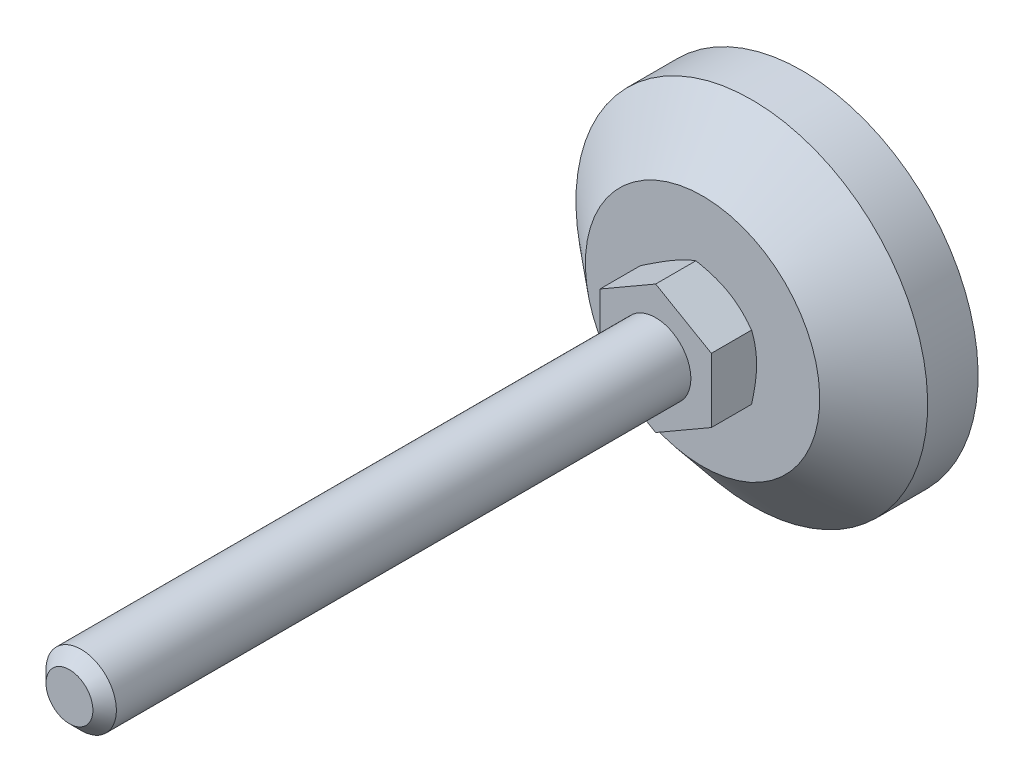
ISO-10303-21;
HEADER;
FILE_DESCRIPTION(('STEP AP214'),'2;1');
FILE_NAME('part.step','',(''),(''),'','','');
FILE_SCHEMA(('AUTOMOTIVE_DESIGN { 1 0 10303 214 1 1 1 1 }'));
ENDSEC;
DATA;
#1=APPLICATION_CONTEXT('core data for automotive mechanical design processes');
#2=APPLICATION_PROTOCOL_DEFINITION('international standard','automotive_design',2000,#1);
#3=PRODUCT_CONTEXT('',#1,'mechanical');
#4=PRODUCT('Part','Part','',(#3));
#5=PRODUCT_RELATED_PRODUCT_CATEGORY('part','',(#4));
#6=PRODUCT_DEFINITION_FORMATION('','',#4);
#7=PRODUCT_DEFINITION_CONTEXT('part definition',#1,'design');
#8=PRODUCT_DEFINITION('design','',#6,#7);
#9=PRODUCT_DEFINITION_SHAPE('','',#8);
#10=(LENGTH_UNIT() NAMED_UNIT(*) SI_UNIT(.MILLI.,.METRE.));
#11=(NAMED_UNIT(*) PLANE_ANGLE_UNIT() SI_UNIT($,.RADIAN.));
#12=(NAMED_UNIT(*) SI_UNIT($,.STERADIAN.) SOLID_ANGLE_UNIT());
#13=UNCERTAINTY_MEASURE_WITH_UNIT(LENGTH_MEASURE(1.E-05),#10,'distance_accuracy_value','');
#14=(GEOMETRIC_REPRESENTATION_CONTEXT(3) GLOBAL_UNCERTAINTY_ASSIGNED_CONTEXT((#13)) GLOBAL_UNIT_ASSIGNED_CONTEXT((#10,
#11,#12)) REPRESENTATION_CONTEXT('',''));
#15=CARTESIAN_POINT('',(0.,0.,0.));
#16=DIRECTION('',(0.,0.,1.));
#17=DIRECTION('',(1.,0.,0.));
#18=AXIS2_PLACEMENT_3D('',#15,#16,#17);
#19=CARTESIAN_POINT('',(0.,0.,25.));
#20=DIRECTION('',(0.,0.,1.));
#21=DIRECTION('',(0.5,-0.866025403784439,0.));
#22=AXIS2_PLACEMENT_3D('',#19,#20,#21);
#23=PLANE('',#22);
#24=DIRECTION('',(0.,1.,0.));
#25=VECTOR('',#24,1.);
#26=CARTESIAN_POINT('',(9.5,-5.48482755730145,25.));
#27=LINE('',#26,#25);
#28=CARTESIAN_POINT('',(9.5,-5.48482755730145,25.));
#29=VERTEX_POINT('',#28);
#30=CARTESIAN_POINT('',(9.5,5.48482755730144,25.));
#31=VERTEX_POINT('',#30);
#32=EDGE_CURVE('E197',#29,#31,#27,.T.);
#33=ORIENTED_EDGE('',*,*,#32,.T.);
#34=DIRECTION('',(-0.866025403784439,0.5,0.));
#35=VECTOR('',#34,1.);
#36=CARTESIAN_POINT('',(9.5,5.48482755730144,25.));
#37=LINE('',#36,#35);
#38=CARTESIAN_POINT('',(0.,10.9696551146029,25.));
#39=VERTEX_POINT('',#38);
#40=EDGE_CURVE('E320',#31,#39,#37,.T.);
#41=ORIENTED_EDGE('',*,*,#40,.T.);
#42=DIRECTION('',(-0.866025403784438,-0.5,0.));
#43=VECTOR('',#42,1.);
#44=CARTESIAN_POINT('',(0.,10.9696551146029,25.));
#45=LINE('',#44,#43);
#46=CARTESIAN_POINT('',(-9.5,5.48482755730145,25.));
#47=VERTEX_POINT('',#46);
#48=EDGE_CURVE('E319',#39,#47,#45,.T.);
#49=ORIENTED_EDGE('',*,*,#48,.T.);
#50=DIRECTION('',(0.,-1.,0.));
#51=VECTOR('',#50,1.);
#52=CARTESIAN_POINT('',(-9.5,5.48482755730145,25.));
#53=LINE('',#52,#51);
#54=CARTESIAN_POINT('',(-9.5,-5.48482755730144,25.));
#55=VERTEX_POINT('',#54);
#56=EDGE_CURVE('E324',#47,#55,#53,.T.);
#57=ORIENTED_EDGE('',*,*,#56,.T.);
#58=DIRECTION('',(0.866025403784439,-0.5,0.));
#59=VECTOR('',#58,1.);
#60=CARTESIAN_POINT('',(-9.5,-5.48482755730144,25.));
#61=LINE('',#60,#59);
#62=CARTESIAN_POINT('',(0.,-10.9696551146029,25.));
#63=VERTEX_POINT('',#62);
#64=EDGE_CURVE('E326',#55,#63,#61,.T.);
#65=ORIENTED_EDGE('',*,*,#64,.T.);
#66=DIRECTION('',(0.866025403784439,0.5,0.));
#67=VECTOR('',#66,1.);
#68=CARTESIAN_POINT('',(0.,-10.9696551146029,25.));
#69=LINE('',#68,#67);
#70=EDGE_CURVE('E37',#63,#29,#69,.T.);
#71=ORIENTED_EDGE('',*,*,#70,.T.);
#72=EDGE_LOOP('',(#33,#41,#49,#57,#65,#71));
#73=FACE_BOUND('',#72,.T.);
#74=CARTESIAN_POINT('',(0.,0.,25.));
#75=DIRECTION('',(0.,0.,1.));
#76=DIRECTION('',(0.5,-0.866025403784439,0.));
#77=AXIS2_PLACEMENT_3D('',#74,#75,#76);
#78=CIRCLE('',#77,6.);
#79=CARTESIAN_POINT('',(3.,-5.19615242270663,25.));
#80=VERTEX_POINT('',#79);
#81=EDGE_CURVE('E201',#80,#80,#78,.T.);
#82=ORIENTED_EDGE('',*,*,#81,.F.);
#83=EDGE_LOOP('',(#82));
#84=FACE_BOUND('',#83,.T.);
#85=ADVANCED_FACE('F14',(#73,#84),#23,.T.);
#86=CARTESIAN_POINT('',(-9.99463491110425,17.3112154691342,17.));
#87=DIRECTION('',(0.,0.,1.));
#88=DIRECTION('',(0.5,-0.866025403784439,0.));
#89=AXIS2_PLACEMENT_3D('',#86,#87,#88);
#90=PLANE('',#89);
#91=CARTESIAN_POINT('',(0.,0.,17.));
#92=DIRECTION('',(0.,0.,-1.));
#93=DIRECTION('',(-0.5,0.866025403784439,0.));
#94=AXIS2_PLACEMENT_3D('',#91,#92,#93);
#95=CIRCLE('',#94,19.9892698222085);
#96=CARTESIAN_POINT('',(-9.99463491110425,17.3112154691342,17.));
#97=VERTEX_POINT('',#96);
#98=EDGE_CURVE('E102',#97,#97,#95,.T.);
#99=ORIENTED_EDGE('',*,*,#98,.F.);
#100=EDGE_LOOP('',(#99));
#101=FACE_BOUND('',#100,.T.);
#102=CARTESIAN_POINT('',(0.,0.,17.));
#103=DIRECTION('',(0.,0.,-1.));
#104=DIRECTION('',(-0.5,0.866025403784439,0.));
#105=AXIS2_PLACEMENT_3D('',#102,#103,#104);
#106=CIRCLE('',#105,9.);
#107=CARTESIAN_POINT('',(-4.5,7.79422863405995,17.));
#108=VERTEX_POINT('',#107);
#109=EDGE_CURVE('E84',#108,#108,#106,.T.);
#110=ORIENTED_EDGE('',*,*,#109,.T.);
#111=EDGE_LOOP('',(#110));
#112=FACE_BOUND('',#111,.T.);
#113=ADVANCED_FACE('F174',(#101,#112),#90,.T.);
#114=CARTESIAN_POINT('',(0.,0.,0.));
#115=DIRECTION('',(0.,0.,-1.));
#116=DIRECTION('',(-0.5,0.866025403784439,0.));
#117=AXIS2_PLACEMENT_3D('',#114,#115,#116);
#118=PLANE('',#117);
#119=CARTESIAN_POINT('',(0.,0.,0.));
#120=DIRECTION('',(0.,0.,-1.));
#121=DIRECTION('',(-0.5,0.866025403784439,0.));
#122=AXIS2_PLACEMENT_3D('',#119,#120,#121);
#123=CIRCLE('',#122,30.);
#124=CARTESIAN_POINT('',(-15.,25.9807621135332,0.));
#125=VERTEX_POINT('',#124);
#126=EDGE_CURVE('E73',#125,#125,#123,.T.);
#127=ORIENTED_EDGE('',*,*,#126,.T.);
#128=EDGE_LOOP('',(#127));
#129=FACE_BOUND('',#128,.T.);
#130=ADVANCED_FACE('F177',(#129),#118,.T.);
#131=CARTESIAN_POINT('',(0.,0.,-75.4972525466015));
#132=DIRECTION('',(0.,0.,-1.));
#133=DIRECTION('',(-0.5,0.866025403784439,0.));
#134=AXIS2_PLACEMENT_3D('',#131,#132,#133);
#135=CYLINDRICAL_SURFACE('',#134,30.);
#136=CARTESIAN_POINT('',(0.,0.,8.6));
#137=DIRECTION('',(0.,0.,-1.));
#138=DIRECTION('',(-0.5,0.866025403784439,0.));
#139=AXIS2_PLACEMENT_3D('',#136,#137,#138);
#140=CIRCLE('',#139,30.);
#141=CARTESIAN_POINT('',(-15.,25.9807621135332,8.6));
#142=VERTEX_POINT('',#141);
#143=EDGE_CURVE('E105',#142,#142,#140,.T.);
#144=ORIENTED_EDGE('',*,*,#143,.T.);
#145=EDGE_LOOP('',(#144));
#146=FACE_BOUND('',#145,.T.);
#147=ORIENTED_EDGE('',*,*,#126,.F.);
#148=EDGE_LOOP('',(#147));
#149=FACE_BOUND('',#148,.T.);
#150=ADVANCED_FACE('F181',(#146,#149),#135,.T.);
#151=CARTESIAN_POINT('',(0.,0.,8.6));
#152=DIRECTION('',(0.,0.,-1.));
#153=DIRECTION('',(-0.5,0.866025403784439,0.));
#154=AXIS2_PLACEMENT_3D('',#151,#152,#153);
#155=CONICAL_SURFACE('',#154,30.,0.872664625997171);
#156=ORIENTED_EDGE('',*,*,#98,.T.);
#157=EDGE_LOOP('',(#156));
#158=FACE_BOUND('',#157,.T.);
#159=ORIENTED_EDGE('',*,*,#143,.F.);
#160=EDGE_LOOP('',(#159));
#161=FACE_BOUND('',#160,.T.);
#162=ADVANCED_FACE('F121',(#158,#161),#155,.T.);
#163=CARTESIAN_POINT('',(0.,0.,20.2070856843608));
#164=DIRECTION('',(0.,0.,1.));
#165=DIRECTION('',(0.5,-0.866025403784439,0.));
#166=AXIS2_PLACEMENT_3D('',#163,#164,#165);
#167=CONICAL_SURFACE('',#166,14.5548353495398,1.0471975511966);
#168=ORIENTED_EDGE('',*,*,#109,.F.);
#169=EDGE_LOOP('',(#168));
#170=FACE_BOUND('',#169,.T.);
#171=CARTESIAN_POINT('',(-8.0629212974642,-15.6247848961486,21.955113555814));
#172=CARTESIAN_POINT('',(-7.88302842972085,-15.5209237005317,21.8541996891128));
#173=CARTESIAN_POINT('',(-7.70292590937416,-15.4169414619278,21.7537843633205));
#174=CARTESIAN_POINT('',(-7.34225784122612,-15.2087096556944,21.5540635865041));
#175=CARTESIAN_POINT('',(-7.16169228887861,-15.1044600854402,21.4547581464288));
#176=CARTESIAN_POINT('',(-6.61918813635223,-14.7912451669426,21.158650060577));
#177=CARTESIAN_POINT('',(-6.25649443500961,-14.5818438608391,20.9636851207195));
#178=CARTESIAN_POINT('',(-5.52674967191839,-14.1605255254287,20.5787866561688));
#179=CARTESIAN_POINT('',(-5.15968567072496,-13.9486010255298,20.3888857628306));
#180=CARTESIAN_POINT('',(-4.42265753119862,-13.5230776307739,20.016769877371));
#181=CARTESIAN_POINT('',(-4.05269352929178,-13.3094788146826,19.834554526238));
#182=CARTESIAN_POINT('',(-3.29714002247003,-12.8732597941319,19.4740509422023));
#183=CARTESIAN_POINT('',(-2.911434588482,-12.650572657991,19.2960849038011));
#184=CARTESIAN_POINT('',(-2.1355321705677,-12.2026051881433,18.953471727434));
#185=CARTESIAN_POINT('',(-1.74533469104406,-11.9773245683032,18.7888260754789));
#186=CARTESIAN_POINT('',(-0.960535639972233,-11.5242206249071,18.4771310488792));
#187=CARTESIAN_POINT('',(-0.565944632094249,-11.2964034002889,18.3300465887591));
#188=CARTESIAN_POINT('',(0.228883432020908,-10.8375092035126,18.0581506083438));
#189=CARTESIAN_POINT('',(0.62911868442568,-10.6064332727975,17.9333321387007));
#190=CARTESIAN_POINT('',(1.43330236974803,-10.1421376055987,17.7125905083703));
#191=CARTESIAN_POINT('',(1.83721725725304,-9.90893723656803,17.6165087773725));
#192=CARTESIAN_POINT('',(2.44681047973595,-9.55698842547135,17.4980679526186));
#193=CARTESIAN_POINT('',(2.65064289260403,-9.4393057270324,17.4628663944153));
#194=CARTESIAN_POINT('',(3.05933909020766,-9.20334486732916,17.4017128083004));
#195=CARTESIAN_POINT('',(3.26420277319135,-9.08506676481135,17.3757598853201));
#196=CARTESIAN_POINT('',(3.67198665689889,-8.84963262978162,17.3339494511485));
#197=CARTESIAN_POINT('',(3.87489694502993,-8.73248232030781,17.3179635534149));
#198=CARTESIAN_POINT('',(4.28112129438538,-8.49794858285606,17.2959174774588));
#199=CARTESIAN_POINT('',(4.48443534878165,-8.38056515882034,17.2898571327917));
#200=CARTESIAN_POINT('',(4.89110353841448,-8.14577517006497,17.2878069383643));
#201=CARTESIAN_POINT('',(5.09445767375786,-8.02836860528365,17.2918171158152));
#202=CARTESIAN_POINT('',(5.50083733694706,-7.79374519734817,17.3098091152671));
#203=CARTESIAN_POINT('',(5.70386284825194,-7.67652836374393,17.3237914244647));
#204=CARTESIAN_POINT('',(6.19015483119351,-7.39576755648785,17.3689276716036));
#205=CARTESIAN_POINT('',(6.47310620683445,-7.23240550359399,17.4047077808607));
#206=CARTESIAN_POINT('',(7.03693098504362,-6.90688111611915,17.4936993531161));
#207=CARTESIAN_POINT('',(7.31780410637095,-6.74471894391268,17.546913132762));
#208=CARTESIAN_POINT('',(8.15697152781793,-6.2602254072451,17.729885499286));
#209=CARTESIAN_POINT('',(8.71150741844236,-5.94006396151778,17.8829428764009));
#210=CARTESIAN_POINT('',(9.54078576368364,-5.4612798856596,18.148698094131));
#211=CARTESIAN_POINT('',(9.819821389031,-5.30017859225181,18.2445639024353));
#212=CARTESIAN_POINT('',(10.375183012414,-4.97954040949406,18.4463370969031));
#213=CARTESIAN_POINT('',(10.6515089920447,-4.82000353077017,18.552244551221));
#214=CARTESIAN_POINT('',(11.201537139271,-4.50244463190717,18.7723946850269));
#215=CARTESIAN_POINT('',(11.4752401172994,-4.34442214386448,18.8866346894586));
#216=CARTESIAN_POINT('',(12.0203730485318,-4.02968949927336,19.1220972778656));
#217=CARTESIAN_POINT('',(12.2918030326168,-3.87297932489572,19.2433197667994));
#218=CARTESIAN_POINT('',(12.9489666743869,-3.4935657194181,19.544986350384));
#219=CARTESIAN_POINT('',(13.3336498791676,-3.27146876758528,19.7284765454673));
#220=CARTESIAN_POINT('',(14.0996081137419,-2.82924257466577,20.104736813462));
#221=CARTESIAN_POINT('',(14.4808829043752,-2.60911347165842,20.2975075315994));
#222=CARTESIAN_POINT('',(15.2406869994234,-2.170440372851,20.6904048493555));
#223=CARTESIAN_POINT('',(15.619215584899,-1.95189679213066,20.8905332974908));
#224=CARTESIAN_POINT('',(16.3739075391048,-1.51617518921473,21.2966079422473));
#225=CARTESIAN_POINT('',(16.7500709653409,-1.29899713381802,21.5025539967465));
#226=CARTESIAN_POINT('',(17.5008876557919,-0.865512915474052,21.9193891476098));
#227=CARTESIAN_POINT('',(17.8755385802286,-0.649208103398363,22.1302838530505));
#228=CARTESIAN_POINT('',(18.6232021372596,-0.217544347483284,22.5559100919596));
#229=CARTESIAN_POINT('',(18.9962147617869,-0.00218540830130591,22.7706416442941));
#230=CARTESIAN_POINT('',(19.7408074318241,0.42770537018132,23.203233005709));
#231=CARTESIAN_POINT('',(20.112387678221,0.642237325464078,23.4210923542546));
#232=CARTESIAN_POINT('',(20.8543824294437,1.07062819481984,23.8594435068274));
#233=CARTESIAN_POINT('',(21.2247969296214,1.28448710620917,24.0799353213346));
#234=CARTESIAN_POINT('',(22.2694002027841,1.88758908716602,24.7056802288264));
#235=CARTESIAN_POINT('',(22.9424390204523,2.2761682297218,25.1134927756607));
#236=CARTESIAN_POINT('',(24.2860532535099,3.05190426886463,25.9345548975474));
#237=CARTESIAN_POINT('',(24.9566285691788,3.439061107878,26.3478046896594));
#238=CARTESIAN_POINT('',(26.2940646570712,4.21123019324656,27.1773352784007));
#239=CARTESIAN_POINT('',(26.9609305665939,4.59624540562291,27.5936050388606));
#240=CARTESIAN_POINT('',(27.9600759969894,5.17310228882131,28.2204041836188));
#241=CARTESIAN_POINT('',(28.2929225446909,5.3652713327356,28.4297301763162));
#242=CARTESIAN_POINT('',(28.958275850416,5.74941324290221,28.8490996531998));
#243=CARTESIAN_POINT('',(29.2907826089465,5.94138610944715,29.0591431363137));
#244=CARTESIAN_POINT('',(29.6231390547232,6.13327219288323,29.269503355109));
#245=B_SPLINE_CURVE_WITH_KNOTS('',3,(#171,#172,#173,#174,#175,#176,#177,#178,#179,#180,#181,
#182,#183,#184,#185,#186,#187,#188,#189,#190,#191,#192,#193,#194,#195,#196,#197,#198,#199,#200,
#201,#202,#203,#204,#205,#206,#207,#208,#209,#210,#211,#212,#213,#214,#215,#216,#217,#218,#219,
#220,#221,#222,#223,#224,#225,#226,#227,#228,#229,#230,#231,#232,#233,#234,#235,#236,#237,#238,
#239,#240,#241,#242,#243,#244),.UNSPECIFIED.,.F.,.F.,(4,2,2,2,2,2,2,2,2,2,2,2,2,2,2,2,2,2,2,2,2,
2,2,2,2,2,2,2,2,2,2,2,2,2,2,2,4),(0.,0.692811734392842,1.38563029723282,2.7714693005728,
4.16474840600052,5.55796235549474,6.99664082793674,8.43547957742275,9.87139378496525,
11.3068590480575,12.734250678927,13.4480473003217,14.1617748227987,14.8661077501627,
15.5704288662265,16.2747518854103,16.9791093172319,17.9645860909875,18.9501938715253,
20.9224706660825,21.9308705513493,22.9392772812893,23.9473616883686,24.9554323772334,
26.397088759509,27.838845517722,29.2809670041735,30.7230532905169,32.1668616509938,
33.6106771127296,35.0542821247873,36.4978928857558,39.1308383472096,41.7638892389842,
44.3899112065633,45.7028456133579,47.0157780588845),.UNSPECIFIED.);
#246=CARTESIAN_POINT('',(0.,-10.9696551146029,18.1371809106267));
#247=VERTEX_POINT('',#246);
#248=CARTESIAN_POINT('',(9.5,-5.48482755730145,18.1371809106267));
#249=VERTEX_POINT('',#248);
#250=EDGE_CURVE('E65',#247,#249,#245,.T.);
#251=ORIENTED_EDGE('',*,*,#250,.F.);
#252=CARTESIAN_POINT('',(-9.5002,-5.4847120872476,18.137247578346));
#253=CARTESIAN_POINT('',(-9.29136922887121,-5.60528058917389,18.0676485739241));
#254=CARTESIAN_POINT('',(-9.0817598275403,-5.72629863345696,18.0012084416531));
#255=CARTESIAN_POINT('',(-8.66086011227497,-5.96930519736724,17.8755224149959));
#256=CARTESIAN_POINT('',(-8.44956926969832,-6.09129402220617,17.8162788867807));
#257=CARTESIAN_POINT('',(-7.81229220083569,-6.45922610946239,17.6504897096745));
#258=CARTESIAN_POINT('',(-7.38379023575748,-6.70662183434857,17.5561895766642));
#259=CARTESIAN_POINT('',(-6.74255666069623,-7.07683821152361,17.4456138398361));
#260=CARTESIAN_POINT('',(-6.53174078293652,-7.19855281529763,17.4141149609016));
#261=CARTESIAN_POINT('',(-6.10913296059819,-7.4425455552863,17.3612933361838));
#262=CARTESIAN_POINT('',(-5.89734099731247,-7.56482370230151,17.3399707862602));
#263=CARTESIAN_POINT('',(-5.47340378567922,-7.80958396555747,17.3080481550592));
#264=CARTESIAN_POINT('',(-5.26125925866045,-7.93206566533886,17.2974353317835));
#265=CARTESIAN_POINT('',(-4.83677424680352,-8.17714220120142,17.2871576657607));
#266=CARTESIAN_POINT('',(-4.62443376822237,-8.29973703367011,17.2874924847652));
#267=CARTESIAN_POINT('',(-4.22745800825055,-8.5289310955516,17.2983485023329));
#268=CARTESIAN_POINT('',(-4.04279470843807,-8.63554650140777,17.3075454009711));
#269=CARTESIAN_POINT('',(-3.67389999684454,-8.84852796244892,17.3340405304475));
#270=CARTESIAN_POINT('',(-3.48966861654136,-8.95489399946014,17.3513393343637));
#271=CARTESIAN_POINT('',(-2.937688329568,-9.27357996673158,17.414979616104));
#272=CARTESIAN_POINT('',(-2.57091646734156,-9.48533580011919,17.4730570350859));
#273=CARTESIAN_POINT('',(-1.83348217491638,-9.91109368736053,17.618251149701));
#274=CARTESIAN_POINT('',(-1.46291385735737,-10.1250414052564,17.7059833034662));
#275=CARTESIAN_POINT('',(-0.727303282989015,-10.5497463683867,17.9050988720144));
#276=CARTESIAN_POINT('',(-0.362251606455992,-10.7605090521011,18.0164355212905));
#277=CARTESIAN_POINT('',(0.000200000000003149,-10.9697705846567,18.137247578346));
#278=B_SPLINE_CURVE_WITH_KNOTS('',3,(#252,#253,#254,#255,#256,#257,#258,#259,#260,#261,#262,
#263,#264,#265,#266,#267,#268,#269,#270,#271,#272,#273,#274,#275,#276,#277),.UNSPECIFIED.,.F.,
.F.,(4,2,2,2,2,2,2,2,2,2,2,2,4),(0.,0.752880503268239,1.50600787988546,3.0154687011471,
3.75167336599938,4.48789219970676,5.22323407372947,5.95855322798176,6.59868084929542,
7.23885375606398,8.52010929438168,9.82978009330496,11.1368800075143),.UNSPECIFIED.);
#279=CARTESIAN_POINT('',(-9.5,-5.48482755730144,18.1371809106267));
#280=VERTEX_POINT('',#279);
#281=EDGE_CURVE('E68',#280,#247,#278,.T.);
#282=ORIENTED_EDGE('',*,*,#281,.F.);
#283=CARTESIAN_POINT('',(-9.5,5.48505849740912,18.137247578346));
#284=CARTESIAN_POINT('',(-9.5,5.24392149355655,18.0676485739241));
#285=CARTESIAN_POINT('',(-9.5,5.0018854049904,18.0012084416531));
#286=CARTESIAN_POINT('',(-9.5,4.51587227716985,17.8755224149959));
#287=CARTESIAN_POINT('',(-9.5,4.27189462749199,17.8162788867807));
#288=CARTESIAN_POINT('',(-9.5,3.53603045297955,17.6504897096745));
#289=CARTESIAN_POINT('',(-9.5,3.04123900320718,17.5561895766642));
#290=CARTESIAN_POINT('',(-9.5,2.3008062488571,17.4456138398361));
#291=CARTESIAN_POINT('',(-9.5,2.05737704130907,17.4141149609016));
#292=CARTESIAN_POINT('',(-9.5,1.56939156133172,17.3612933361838));
#293=CARTESIAN_POINT('',(-9.5,1.32483526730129,17.3399707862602));
#294=CARTESIAN_POINT('',(-9.5,0.835314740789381,17.3080481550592));
#295=CARTESIAN_POINT('',(-9.5,0.590351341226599,17.2974353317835));
#296=CARTESIAN_POINT('',(-9.5,0.100198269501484,17.2871576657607));
#297=CARTESIAN_POINT('',(-9.5,-0.144991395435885,17.2874924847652));
#298=CARTESIAN_POINT('',(-9.5,-0.603379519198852,17.2983485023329));
#299=CARTESIAN_POINT('',(-9.5,-0.816610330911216,17.3075454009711));
#300=CARTESIAN_POINT('',(-9.5,-1.24257325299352,17.3340405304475));
#301=CARTESIAN_POINT('',(-9.5,-1.45530532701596,17.3513393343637));
#302=CARTESIAN_POINT('',(-9.5,-2.09267726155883,17.414979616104));
#303=CARTESIAN_POINT('',(-9.5,-2.51618892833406,17.4730570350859));
#304=CARTESIAN_POINT('',(-9.5,-3.36770470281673,17.618251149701));
#305=CARTESIAN_POINT('',(-9.5,-3.79560013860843,17.7059833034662));
#306=CARTESIAN_POINT('',(-9.5,-4.64501006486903,17.9050988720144));
#307=CARTESIAN_POINT('',(-9.5,-5.06653543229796,18.0164355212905));
#308=CARTESIAN_POINT('',(-9.5,-5.48505849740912,18.137247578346));
#309=B_SPLINE_CURVE_WITH_KNOTS('',3,(#283,#284,#285,#286,#287,#288,#289,#290,#291,#292,#293,
#294,#295,#296,#297,#298,#299,#300,#301,#302,#303,#304,#305,#306,#307,#308),.UNSPECIFIED.,.F.,
.F.,(4,2,2,2,2,2,2,2,2,2,2,2,4),(0.,0.752880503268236,1.50600787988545,3.0154687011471,
3.75167336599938,4.48789219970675,5.22323407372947,5.95855322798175,6.59868084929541,
7.23885375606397,8.52010929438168,9.82978009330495,11.1368800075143),.UNSPECIFIED.);
#310=CARTESIAN_POINT('',(-9.5,5.48482755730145,18.1371809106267));
#311=VERTEX_POINT('',#310);
#312=EDGE_CURVE('E83',#311,#280,#309,.T.);
#313=ORIENTED_EDGE('',*,*,#312,.F.);
#314=CARTESIAN_POINT('',(-17.5629212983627,0.829697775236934,21.9551135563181));
#315=CARTESIAN_POINT('',(-17.3830284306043,0.933558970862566,21.8541996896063));
#316=CARTESIAN_POINT('',(-17.2029259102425,1.03754120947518,21.7537843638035));
#317=CARTESIAN_POINT('',(-16.8422578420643,1.245773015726,21.5540635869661));
#318=CARTESIAN_POINT('',(-16.6616922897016,1.35002258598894,21.4547581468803));
#319=CARTESIAN_POINT('',(-16.1191881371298,1.66323750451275,21.1586500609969));
#320=CARTESIAN_POINT('',(-15.7564944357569,1.8726388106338,20.9636851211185));
#321=CARTESIAN_POINT('',(-15.0267496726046,2.29395714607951,20.5787866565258));
#322=CARTESIAN_POINT('',(-14.6596856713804,2.50588164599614,20.3888857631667));
#323=CARTESIAN_POINT('',(-13.9226575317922,2.93140504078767,20.0167698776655));
#324=CARTESIAN_POINT('',(-13.5526935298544,3.14500385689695,19.8345545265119));
#325=CARTESIAN_POINT('',(-12.7971400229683,3.58122287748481,19.4740509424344));
#326=CARTESIAN_POINT('',(-12.4114345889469,3.80391001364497,19.296084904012));
#327=CARTESIAN_POINT('',(-11.6355321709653,4.25187748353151,18.9534717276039));
#328=CARTESIAN_POINT('',(-11.2453346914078,4.47715810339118,18.7888260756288));
#329=CARTESIAN_POINT('',(-10.4605356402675,4.93026204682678,18.477131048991));
#330=CARTESIAN_POINT('',(-10.065944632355,5.15807927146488,18.3300465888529));
#331=CARTESIAN_POINT('',(-9.27111656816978,5.61697346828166,18.0581506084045));
#332=CARTESIAN_POINT('',(-8.87088131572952,5.84804939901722,17.9333321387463));
#333=CARTESIAN_POINT('',(-8.06669763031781,6.31234506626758,17.7125905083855));
#334=CARTESIAN_POINT('',(-7.66278274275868,6.54554543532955,17.6165087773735));
#335=CARTESIAN_POINT('',(-7.05318952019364,6.89749424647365,17.4980679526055));
#336=CARTESIAN_POINT('',(-6.84935710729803,7.0151769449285,17.4628663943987));
#337=CARTESIAN_POINT('',(-6.44066090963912,7.25113780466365,17.4017128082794));
#338=CARTESIAN_POINT('',(-6.23579722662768,7.36941590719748,17.3757598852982));
#339=CARTESIAN_POINT('',(-5.82801334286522,7.60485004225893,17.3339494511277));
#340=CARTESIAN_POINT('',(-5.62510305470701,7.72200035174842,17.3179635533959));
#341=CARTESIAN_POINT('',(-5.21887870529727,7.95653408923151,17.2959174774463));
#342=CARTESIAN_POINT('',(-5.01556465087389,8.07391751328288,17.2898571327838));
#343=CARTESIAN_POINT('',(-4.60889646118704,8.30870750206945,17.2878069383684));
#344=CARTESIAN_POINT('',(-4.40554232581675,8.42611406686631,17.2918171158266));
#345=CARTESIAN_POINT('',(-3.9991626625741,8.66073747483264,17.3098091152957));
#346=CARTESIAN_POINT('',(-3.79613715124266,8.7779543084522,17.3237914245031));
#347=CARTESIAN_POINT('',(-3.30984516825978,9.05871511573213,17.3689276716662));
#348=CARTESIAN_POINT('',(-3.0268937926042,9.22207716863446,17.4047077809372));
#349=CARTESIAN_POINT('',(-2.46306901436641,9.54760155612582,17.4936993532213));
#350=CARTESIAN_POINT('',(-2.18219589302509,9.70976372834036,17.5469131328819));
#351=CARTESIAN_POINT('',(-1.34302847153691,10.1942572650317,17.7298854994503));
#352=CARTESIAN_POINT('',(-0.788492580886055,10.5144187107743,17.8829428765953));
#353=CARTESIAN_POINT('',(0.0407857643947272,10.9932027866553,18.1486980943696));
#354=CARTESIAN_POINT('',(0.319821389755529,11.1543040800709,18.2445639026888));
#355=CARTESIAN_POINT('',(0.875183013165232,11.474942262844,18.4463370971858));
#356=CARTESIAN_POINT('',(1.15150899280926,11.6344791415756,18.5522445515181));
#357=CARTESIAN_POINT('',(1.70153714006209,11.9520380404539,18.7723946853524));
#358=CARTESIAN_POINT('',(1.97524011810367,12.1100605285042,18.886634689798));
#359=CARTESIAN_POINT('',(2.52037304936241,12.4247931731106,19.1220972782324));
#360=CARTESIAN_POINT('',(2.79180303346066,12.5815033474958,19.2433197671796));
#361=CARTESIAN_POINT('',(3.44896667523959,12.9609169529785,19.5449863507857));
#362=CARTESIAN_POINT('',(3.8336498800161,13.183013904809,19.728476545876));
#363=CARTESIAN_POINT('',(4.5996081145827,13.625240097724,20.1047368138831));
#364=CARTESIAN_POINT('',(4.98088290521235,13.8453692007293,20.2975075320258));
#365=CARTESIAN_POINT('',(5.74068700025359,14.2840422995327,20.6904048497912));
#366=CARTESIAN_POINT('',(6.11921558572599,14.5025858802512,20.8905332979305));
#367=CARTESIAN_POINT('',(6.87390753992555,14.9383074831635,21.2966079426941));
#368=CARTESIAN_POINT('',(7.25007096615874,15.1554855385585,21.5025539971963));
#369=CARTESIAN_POINT('',(8.00088765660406,15.5889697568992,21.9193891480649));
#370=CARTESIAN_POINT('',(8.37553858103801,15.8052745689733,22.1302838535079));
#371=CARTESIAN_POINT('',(9.12320213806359,16.2369383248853,22.5559100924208));
#372=CARTESIAN_POINT('',(9.49621476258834,16.4522972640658,22.7706416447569));
#373=CARTESIAN_POINT('',(10.2408074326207,16.8821880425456,23.2032330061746));
#374=CARTESIAN_POINT('',(10.6123876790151,17.0967199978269,23.4210923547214));
#375=CARTESIAN_POINT('',(11.3543824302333,17.5251108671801,23.8594435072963));
#376=CARTESIAN_POINT('',(11.7247969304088,17.7389697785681,24.0799353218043));
#377=CARTESIAN_POINT('',(12.7694002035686,18.3420717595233,24.7056802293));
#378=CARTESIAN_POINT('',(13.4424390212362,18.7306509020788,25.113492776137));
#379=CARTESIAN_POINT('',(14.786053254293,19.5063869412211,25.9345548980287));
#380=CARTESIAN_POINT('',(15.4566285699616,19.8935437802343,26.3478046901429));
#381=CARTESIAN_POINT('',(16.7940646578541,20.665712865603,27.1773352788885));
#382=CARTESIAN_POINT('',(17.4609305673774,21.0507280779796,27.5936050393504));
#383=CARTESIAN_POINT('',(18.4600759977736,21.6275849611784,28.2204041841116));
#384=CARTESIAN_POINT('',(18.7929225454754,21.8197540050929,28.42973017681));
#385=CARTESIAN_POINT('',(19.4582758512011,22.2038959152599,28.8490996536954));
#386=CARTESIAN_POINT('',(19.7907826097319,22.395868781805,29.0591431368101));
#387=CARTESIAN_POINT('',(20.1231390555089,22.5877548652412,29.2695033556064));
#388=B_SPLINE_CURVE_WITH_KNOTS('',3,(#314,#315,#316,#317,#318,#319,#320,#321,#322,#323,#324,
#325,#326,#327,#328,#329,#330,#331,#332,#333,#334,#335,#336,#337,#338,#339,#340,#341,#342,#343,
#344,#345,#346,#347,#348,#349,#350,#351,#352,#353,#354,#355,#356,#357,#358,#359,#360,#361,#362,
#363,#364,#365,#366,#367,#368,#369,#370,#371,#372,#373,#374,#375,#376,#377,#378,#379,#380,#381,
#382,#383,#384,#385,#386,#387),.UNSPECIFIED.,.F.,.F.,(4,2,2,2,2,2,2,2,2,2,2,2,2,2,2,2,2,2,2,2,2,
2,2,2,2,2,2,2,2,2,2,2,2,2,2,2,4),(0.,0.692811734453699,1.38563029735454,2.77146930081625,
4.16474840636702,5.55796235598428,6.99664082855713,8.43547957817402,9.87139378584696,
11.3068590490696,12.7342506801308,13.4480473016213,14.1617748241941,14.8661077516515,
15.5704288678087,16.2747518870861,16.9791093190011,17.9645860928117,18.9501938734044,
20.9224706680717,21.9308705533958,22.9392772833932,23.9473616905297,24.9554323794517,
26.3970887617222,27.8388455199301,29.2809670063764,30.7230532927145,32.1668616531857,
33.6106771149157,35.0542821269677,36.4978928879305,39.1308383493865,41.7638892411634,
44.3899112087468,45.7028456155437,47.0157780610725),.UNSPECIFIED.);
#389=CARTESIAN_POINT('',(0.,10.9696551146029,18.1371809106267));
#390=VERTEX_POINT('',#389);
#391=EDGE_CURVE('E143',#390,#311,#388,.F.);
#392=ORIENTED_EDGE('',*,*,#391,.F.);
#393=CARTESIAN_POINT('',(9.5002,5.4847120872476,18.137247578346));
#394=CARTESIAN_POINT('',(9.29136922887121,5.60528058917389,18.0676485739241));
#395=CARTESIAN_POINT('',(9.0817598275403,5.72629863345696,18.0012084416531));
#396=CARTESIAN_POINT('',(8.66086011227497,5.96930519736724,17.8755224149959));
#397=CARTESIAN_POINT('',(8.44956926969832,6.09129402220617,17.8162788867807));
#398=CARTESIAN_POINT('',(7.81229220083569,6.45922610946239,17.6504897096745));
#399=CARTESIAN_POINT('',(7.38379023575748,6.70662183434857,17.5561895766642));
#400=CARTESIAN_POINT('',(6.74255666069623,7.07683821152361,17.4456138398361));
#401=CARTESIAN_POINT('',(6.53174078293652,7.19855281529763,17.4141149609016));
#402=CARTESIAN_POINT('',(6.10913296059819,7.4425455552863,17.3612933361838));
#403=CARTESIAN_POINT('',(5.89734099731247,7.56482370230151,17.3399707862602));
#404=CARTESIAN_POINT('',(5.47340378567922,7.80958396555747,17.3080481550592));
#405=CARTESIAN_POINT('',(5.26125925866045,7.93206566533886,17.2974353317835));
#406=CARTESIAN_POINT('',(4.83677424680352,8.17714220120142,17.2871576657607));
#407=CARTESIAN_POINT('',(4.62443376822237,8.29973703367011,17.2874924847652));
#408=CARTESIAN_POINT('',(4.22745800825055,8.5289310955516,17.2983485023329));
#409=CARTESIAN_POINT('',(4.04279470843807,8.63554650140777,17.3075454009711));
#410=CARTESIAN_POINT('',(3.67389999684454,8.84852796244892,17.3340405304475));
#411=CARTESIAN_POINT('',(3.48966861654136,8.95489399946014,17.3513393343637));
#412=CARTESIAN_POINT('',(2.937688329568,9.27357996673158,17.414979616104));
#413=CARTESIAN_POINT('',(2.57091646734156,9.48533580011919,17.4730570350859));
#414=CARTESIAN_POINT('',(1.83348217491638,9.91109368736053,17.618251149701));
#415=CARTESIAN_POINT('',(1.46291385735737,10.1250414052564,17.7059833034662));
#416=CARTESIAN_POINT('',(0.727303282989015,10.5497463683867,17.9050988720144));
#417=CARTESIAN_POINT('',(0.362251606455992,10.7605090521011,18.0164355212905));
#418=CARTESIAN_POINT('',(-0.000200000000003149,10.9697705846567,18.137247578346));
#419=B_SPLINE_CURVE_WITH_KNOTS('',3,(#393,#394,#395,#396,#397,#398,#399,#400,#401,#402,#403,
#404,#405,#406,#407,#408,#409,#410,#411,#412,#413,#414,#415,#416,#417,#418),.UNSPECIFIED.,.F.,
.F.,(4,2,2,2,2,2,2,2,2,2,2,2,4),(0.,0.752880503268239,1.50600787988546,3.0154687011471,
3.75167336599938,4.48789219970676,5.22323407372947,5.95855322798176,6.59868084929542,
7.23885375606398,8.52010929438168,9.82978009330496,11.1368800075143),.UNSPECIFIED.);
#420=CARTESIAN_POINT('',(9.5,5.48482755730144,18.1371809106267));
#421=VERTEX_POINT('',#420);
#422=EDGE_CURVE('E150',#421,#390,#419,.T.);
#423=ORIENTED_EDGE('',*,*,#422,.F.);
#424=CARTESIAN_POINT('',(9.5,-5.48505849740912,18.137247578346));
#425=CARTESIAN_POINT('',(9.5,-5.24392149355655,18.0676485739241));
#426=CARTESIAN_POINT('',(9.5,-5.00188540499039,18.0012084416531));
#427=CARTESIAN_POINT('',(9.5,-4.51587227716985,17.8755224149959));
#428=CARTESIAN_POINT('',(9.5,-4.27189462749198,17.8162788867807));
#429=CARTESIAN_POINT('',(9.5,-3.53603045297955,17.6504897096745));
#430=CARTESIAN_POINT('',(9.5,-3.04123900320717,17.5561895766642));
#431=CARTESIAN_POINT('',(9.5,-2.3008062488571,17.4456138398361));
#432=CARTESIAN_POINT('',(9.5,-2.05737704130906,17.4141149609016));
#433=CARTESIAN_POINT('',(9.5,-1.56939156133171,17.3612933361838));
#434=CARTESIAN_POINT('',(9.5,-1.32483526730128,17.3399707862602));
#435=CARTESIAN_POINT('',(9.5,-0.83531474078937,17.3080481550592));
#436=CARTESIAN_POINT('',(9.5,-0.590351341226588,17.2974353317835));
#437=CARTESIAN_POINT('',(9.5,-0.100198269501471,17.2871576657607));
#438=CARTESIAN_POINT('',(9.5,0.144991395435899,17.2874924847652));
#439=CARTESIAN_POINT('',(9.5,0.603379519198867,17.2983485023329));
#440=CARTESIAN_POINT('',(9.5,0.816610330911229,17.3075454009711));
#441=CARTESIAN_POINT('',(9.5,1.24257325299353,17.3340405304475));
#442=CARTESIAN_POINT('',(9.5,1.45530532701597,17.3513393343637));
#443=CARTESIAN_POINT('',(9.5,2.09267726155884,17.414979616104));
#444=CARTESIAN_POINT('',(9.5,2.51618892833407,17.4730570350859));
#445=CARTESIAN_POINT('',(9.5,3.36770470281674,17.618251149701));
#446=CARTESIAN_POINT('',(9.5,3.79560013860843,17.7059833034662));
#447=CARTESIAN_POINT('',(9.5,4.64501006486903,17.9050988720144));
#448=CARTESIAN_POINT('',(9.5,5.06653543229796,18.0164355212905));
#449=CARTESIAN_POINT('',(9.5,5.48505849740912,18.137247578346));
#450=B_SPLINE_CURVE_WITH_KNOTS('',3,(#424,#425,#426,#427,#428,#429,#430,#431,#432,#433,#434,
#435,#436,#437,#438,#439,#440,#441,#442,#443,#444,#445,#446,#447,#448,#449),.UNSPECIFIED.,.F.,
.F.,(4,2,2,2,2,2,2,2,2,2,2,2,4),(0.,0.75288050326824,1.50600787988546,3.01546870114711,
3.75167336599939,4.48789219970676,5.22323407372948,5.95855322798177,6.59868084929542,
7.23885375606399,8.52010929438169,9.82978009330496,11.1368800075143),.UNSPECIFIED.);
#451=EDGE_CURVE('E29',#249,#421,#450,.T.);
#452=ORIENTED_EDGE('',*,*,#451,.F.);
#453=EDGE_LOOP('',(#251,#282,#313,#392,#423,#452));
#454=FACE_BOUND('',#453,.T.);
#455=ADVANCED_FACE('F67',(#170,#454),#167,.T.);
#456=CARTESIAN_POINT('',(0.,-10.9696551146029,25.));
#457=DIRECTION('',(-0.5,0.866025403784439,0.));
#458=DIRECTION('',(0.,0.,1.));
#459=AXIS2_PLACEMENT_3D('',#456,#457,#458);
#460=PLANE('',#459);
#461=DIRECTION('',(0.,0.,-1.));
#462=VECTOR('',#461,1.);
#463=CARTESIAN_POINT('',(0.,-10.9696551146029,25.));
#464=LINE('',#463,#462);
#465=EDGE_CURVE('E80',#63,#247,#464,.T.);
#466=ORIENTED_EDGE('',*,*,#465,.T.);
#467=ORIENTED_EDGE('',*,*,#250,.T.);
#468=DIRECTION('',(0.,0.,-1.));
#469=VECTOR('',#468,1.);
#470=CARTESIAN_POINT('',(9.5,-5.48482755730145,25.));
#471=LINE('',#470,#469);
#472=EDGE_CURVE('E87',#29,#249,#471,.T.);
#473=ORIENTED_EDGE('',*,*,#472,.F.);
#474=ORIENTED_EDGE('',*,*,#70,.F.);
#475=EDGE_LOOP('',(#466,#467,#473,#474));
#476=FACE_BOUND('',#475,.T.);
#477=ADVANCED_FACE('F86',(#476),#460,.F.);
#478=CARTESIAN_POINT('',(-9.5,-5.48482755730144,25.));
#479=DIRECTION('',(0.5,0.866025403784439,0.));
#480=DIRECTION('',(-0.866025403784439,0.5,0.));
#481=AXIS2_PLACEMENT_3D('',#478,#479,#480);
#482=PLANE('',#481);
#483=DIRECTION('',(0.,0.,-1.));
#484=VECTOR('',#483,1.);
#485=CARTESIAN_POINT('',(-9.5,-5.48482755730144,25.));
#486=LINE('',#485,#484);
#487=EDGE_CURVE('E82',#55,#280,#486,.T.);
#488=ORIENTED_EDGE('',*,*,#487,.T.);
#489=ORIENTED_EDGE('',*,*,#281,.T.);
#490=ORIENTED_EDGE('',*,*,#465,.F.);
#491=ORIENTED_EDGE('',*,*,#64,.F.);
#492=EDGE_LOOP('',(#488,#489,#490,#491));
#493=FACE_BOUND('',#492,.T.);
#494=ADVANCED_FACE('F78',(#493),#482,.F.);
#495=CARTESIAN_POINT('',(-9.5,5.48482755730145,25.));
#496=DIRECTION('',(1.,0.,0.));
#497=DIRECTION('',(0.,1.,0.));
#498=AXIS2_PLACEMENT_3D('',#495,#496,#497);
#499=PLANE('',#498);
#500=DIRECTION('',(0.,0.,-1.));
#501=VECTOR('',#500,1.);
#502=CARTESIAN_POINT('',(-9.5,5.48482755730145,25.));
#503=LINE('',#502,#501);
#504=EDGE_CURVE('E89',#47,#311,#503,.T.);
#505=ORIENTED_EDGE('',*,*,#504,.T.);
#506=ORIENTED_EDGE('',*,*,#312,.T.);
#507=ORIENTED_EDGE('',*,*,#487,.F.);
#508=ORIENTED_EDGE('',*,*,#56,.F.);
#509=EDGE_LOOP('',(#505,#506,#507,#508));
#510=FACE_BOUND('',#509,.T.);
#511=ADVANCED_FACE('F297',(#510),#499,.F.);
#512=CARTESIAN_POINT('',(0.,10.9696551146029,25.));
#513=DIRECTION('',(0.5,-0.866025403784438,0.));
#514=DIRECTION('',(0.866025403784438,0.5,0.));
#515=AXIS2_PLACEMENT_3D('',#512,#513,#514);
#516=PLANE('',#515);
#517=DIRECTION('',(0.,0.,-1.));
#518=VECTOR('',#517,1.);
#519=CARTESIAN_POINT('',(0.,10.9696551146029,25.));
#520=LINE('',#519,#518);
#521=EDGE_CURVE('E96',#39,#390,#520,.T.);
#522=ORIENTED_EDGE('',*,*,#521,.T.);
#523=ORIENTED_EDGE('',*,*,#391,.T.);
#524=ORIENTED_EDGE('',*,*,#504,.F.);
#525=ORIENTED_EDGE('',*,*,#48,.F.);
#526=EDGE_LOOP('',(#522,#523,#524,#525));
#527=FACE_BOUND('',#526,.T.);
#528=ADVANCED_FACE('F167',(#527),#516,.F.);
#529=CARTESIAN_POINT('',(9.5,5.48482755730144,25.));
#530=DIRECTION('',(-0.5,-0.866025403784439,0.));
#531=DIRECTION('',(0.866025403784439,-0.5,0.));
#532=AXIS2_PLACEMENT_3D('',#529,#530,#531);
#533=PLANE('',#532);
#534=DIRECTION('',(0.,0.,-1.));
#535=VECTOR('',#534,1.);
#536=CARTESIAN_POINT('',(9.5,5.48482755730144,25.));
#537=LINE('',#536,#535);
#538=EDGE_CURVE('E99',#31,#421,#537,.T.);
#539=ORIENTED_EDGE('',*,*,#538,.T.);
#540=ORIENTED_EDGE('',*,*,#422,.T.);
#541=ORIENTED_EDGE('',*,*,#521,.F.);
#542=ORIENTED_EDGE('',*,*,#40,.F.);
#543=EDGE_LOOP('',(#539,#540,#541,#542));
#544=FACE_BOUND('',#543,.T.);
#545=ADVANCED_FACE('F163',(#544),#533,.F.);
#546=CARTESIAN_POINT('',(9.5,-5.48482755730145,25.));
#547=DIRECTION('',(-1.,0.,0.));
#548=DIRECTION('',(0.,-1.,0.));
#549=AXIS2_PLACEMENT_3D('',#546,#547,#548);
#550=PLANE('',#549);
#551=ORIENTED_EDGE('',*,*,#472,.T.);
#552=ORIENTED_EDGE('',*,*,#451,.T.);
#553=ORIENTED_EDGE('',*,*,#538,.F.);
#554=ORIENTED_EDGE('',*,*,#32,.F.);
#555=EDGE_LOOP('',(#551,#552,#553,#554));
#556=FACE_BOUND('',#555,.T.);
#557=ADVANCED_FACE('F166',(#556),#550,.F.);
#558=CARTESIAN_POINT('',(0.,0.,125.));
#559=DIRECTION('',(0.,0.,-1.));
#560=DIRECTION('',(-0.5,0.866025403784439,0.));
#561=AXIS2_PLACEMENT_3D('',#558,#559,#560);
#562=CYLINDRICAL_SURFACE('',#561,6.);
#563=CARTESIAN_POINT('',(0.,0.,123.));
#564=DIRECTION('',(0.,0.,1.));
#565=DIRECTION('',(0.5,-0.866025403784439,0.));
#566=AXIS2_PLACEMENT_3D('',#563,#564,#565);
#567=CIRCLE('',#566,6.);
#568=CARTESIAN_POINT('',(3.,-5.19615242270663,123.));
#569=VERTEX_POINT('',#568);
#570=EDGE_CURVE('E9',#569,#569,#567,.F.);
#571=ORIENTED_EDGE('',*,*,#570,.T.);
#572=EDGE_LOOP('',(#571));
#573=FACE_BOUND('',#572,.T.);
#574=ORIENTED_EDGE('',*,*,#81,.T.);
#575=EDGE_LOOP('',(#574));
#576=FACE_BOUND('',#575,.T.);
#577=ADVANCED_FACE('F123',(#573,#576),#562,.T.);
#578=CARTESIAN_POINT('',(0.,0.,125.));
#579=DIRECTION('',(0.,0.,1.));
#580=DIRECTION('',(0.5,-0.866025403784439,0.));
#581=AXIS2_PLACEMENT_3D('',#578,#579,#580);
#582=PLANE('',#581);
#583=CARTESIAN_POINT('',(0.,0.,125.));
#584=DIRECTION('',(0.,0.,1.));
#585=DIRECTION('',(0.5,-0.866025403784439,0.));
#586=AXIS2_PLACEMENT_3D('',#583,#584,#585);
#587=CIRCLE('',#586,4.);
#588=CARTESIAN_POINT('',(2.,-3.46410161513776,125.));
#589=VERTEX_POINT('',#588);
#590=EDGE_CURVE('E22',#589,#589,#587,.T.);
#591=ORIENTED_EDGE('',*,*,#590,.T.);
#592=EDGE_LOOP('',(#591));
#593=FACE_BOUND('',#592,.T.);
#594=ADVANCED_FACE('F208',(#593),#582,.T.);
#595=CARTESIAN_POINT('',(0.,0.,125.));
#596=DIRECTION('',(0.,0.,-1.));
#597=DIRECTION('',(-0.5,0.866025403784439,0.));
#598=AXIS2_PLACEMENT_3D('',#595,#596,#597);
#599=CONICAL_SURFACE('',#598,4.,0.785398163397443);
#600=ORIENTED_EDGE('',*,*,#570,.F.);
#601=EDGE_LOOP('',(#600));
#602=FACE_BOUND('',#601,.T.);
#603=ORIENTED_EDGE('',*,*,#590,.F.);
#604=EDGE_LOOP('',(#603));
#605=FACE_BOUND('',#604,.T.);
#606=ADVANCED_FACE('F16',(#602,#605),#599,.T.);
#607=CLOSED_SHELL('',(#85,#113,#130,#150,#162,#455,#477,#494,#511,#528,#545,#557,#577,#594,#606));
#608=MANIFOLD_SOLID_BREP('B1',#607);
#609=ADVANCED_BREP_SHAPE_REPRESENTATION('',(#18,#608),#14);
#610=SHAPE_DEFINITION_REPRESENTATION(#9,#609);
ENDSEC;
END-ISO-10303-21;
